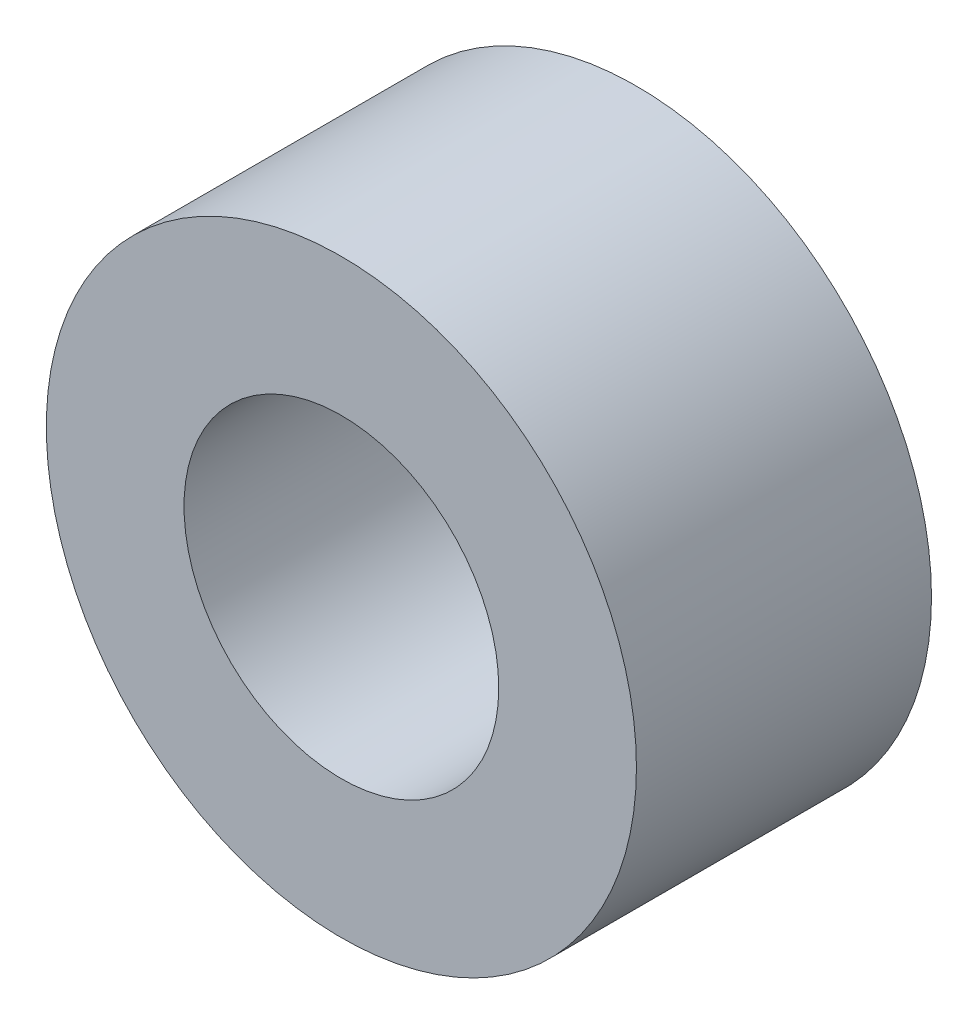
from build123d import *

# Parameters (mm, degrees)
CROQUIS1_R              = 7.5
CROQUIS1_R_2            = 4
SALIENTE_EXTRUIR1_DEPTH = 3.75


with BuildPart() as part:
    # Croquis1 → Saliente-Extruir1 (new, symmetric)
    with BuildSketch(Plane.XY):
        Circle(CROQUIS1_R)
        Circle(CROQUIS1_R_2, mode=Mode.SUBTRACT)
    extrude(amount=SALIENTE_EXTRUIR1_DEPTH, both=True)


solid = part.part
